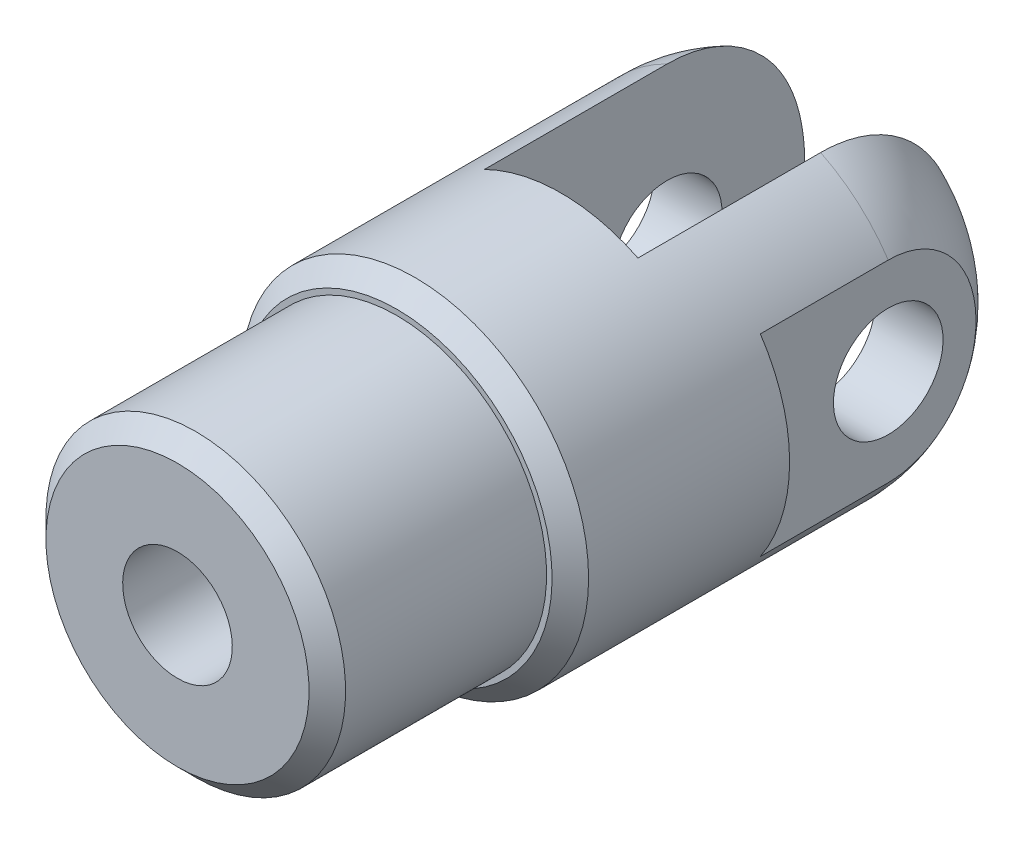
ISO-10303-21;
HEADER;
FILE_DESCRIPTION(('STEP AP214'),'2;1');
FILE_NAME('part.step','',(''),(''),'','','');
FILE_SCHEMA(('AUTOMOTIVE_DESIGN { 1 0 10303 214 1 1 1 1 }'));
ENDSEC;
DATA;
#1=APPLICATION_CONTEXT('core data for automotive mechanical design processes');
#2=APPLICATION_PROTOCOL_DEFINITION('international standard','automotive_design',2000,#1);
#3=PRODUCT_CONTEXT('',#1,'mechanical');
#4=PRODUCT('Part','Part','',(#3));
#5=PRODUCT_RELATED_PRODUCT_CATEGORY('part','',(#4));
#6=PRODUCT_DEFINITION_FORMATION('','',#4);
#7=PRODUCT_DEFINITION_CONTEXT('part definition',#1,'design');
#8=PRODUCT_DEFINITION('design','',#6,#7);
#9=PRODUCT_DEFINITION_SHAPE('','',#8);
#10=(LENGTH_UNIT() NAMED_UNIT(*) SI_UNIT(.MILLI.,.METRE.));
#11=(NAMED_UNIT(*) PLANE_ANGLE_UNIT() SI_UNIT($,.RADIAN.));
#12=(NAMED_UNIT(*) SI_UNIT($,.STERADIAN.) SOLID_ANGLE_UNIT());
#13=UNCERTAINTY_MEASURE_WITH_UNIT(LENGTH_MEASURE(1.E-05),#10,'distance_accuracy_value','');
#14=(GEOMETRIC_REPRESENTATION_CONTEXT(3) GLOBAL_UNCERTAINTY_ASSIGNED_CONTEXT((#13)) GLOBAL_UNIT_ASSIGNED_CONTEXT((#10,
#11,#12)) REPRESENTATION_CONTEXT('',''));
#15=CARTESIAN_POINT('',(0.,0.,0.));
#16=DIRECTION('',(0.,0.,1.));
#17=DIRECTION('',(1.,0.,0.));
#18=AXIS2_PLACEMENT_3D('',#15,#16,#17);
#19=CARTESIAN_POINT('',(0.,0.,11.));
#20=DIRECTION('',(0.,0.,-1.));
#21=DIRECTION('',(0.,1.,0.));
#22=AXIS2_PLACEMENT_3D('',#19,#20,#21);
#23=CONICAL_SURFACE('',#22,8.20000000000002,0.785398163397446);
#24=CARTESIAN_POINT('',(0.,0.,11.));
#25=DIRECTION('',(0.,0.,-1.));
#26=DIRECTION('',(0.,1.,0.));
#27=AXIS2_PLACEMENT_3D('',#24,#25,#26);
#28=CIRCLE('',#27,8.2);
#29=CARTESIAN_POINT('',(0.,8.19999999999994,11.));
#30=VERTEX_POINT('',#29);
#31=EDGE_CURVE('E132',#30,#30,#28,.T.);
#32=ORIENTED_EDGE('',*,*,#31,.F.);
#33=EDGE_LOOP('',(#32));
#34=FACE_BOUND('',#33,.T.);
#35=CARTESIAN_POINT('',(0.,0.,12.0000000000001));
#36=DIRECTION('',(0.,0.,-1.));
#37=DIRECTION('',(0.,1.,0.));
#38=AXIS2_PLACEMENT_3D('',#35,#36,#37);
#39=CIRCLE('',#38,7.2);
#40=CARTESIAN_POINT('',(0.,7.19999999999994,12.0000000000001));
#41=VERTEX_POINT('',#40);
#42=EDGE_CURVE('E19',#41,#41,#39,.F.);
#43=ORIENTED_EDGE('',*,*,#42,.F.);
#44=EDGE_LOOP('',(#43));
#45=FACE_BOUND('',#44,.T.);
#46=ADVANCED_FACE('F16',(#34,#45),#23,.T.);
#47=CARTESIAN_POINT('',(0.,0.,12.0000000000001));
#48=DIRECTION('',(0.,0.,1.));
#49=DIRECTION('',(0.,-1.,0.));
#50=AXIS2_PLACEMENT_3D('',#47,#48,#49);
#51=PLANE('',#50);
#52=ORIENTED_EDGE('',*,*,#42,.T.);
#53=EDGE_LOOP('',(#52));
#54=FACE_BOUND('',#53,.T.);
#55=CARTESIAN_POINT('',(0.,0.,12.0000000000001));
#56=DIRECTION('',(0.,0.,1.));
#57=DIRECTION('',(0.,-1.,0.));
#58=AXIS2_PLACEMENT_3D('',#55,#56,#57);
#59=CIRCLE('',#58,3.);
#60=CARTESIAN_POINT('',(0.,-3.00000000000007,12.0000000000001));
#61=VERTEX_POINT('',#60);
#62=EDGE_CURVE('E135',#61,#61,#59,.F.);
#63=ORIENTED_EDGE('',*,*,#62,.T.);
#64=EDGE_LOOP('',(#63));
#65=FACE_BOUND('',#64,.T.);
#66=ADVANCED_FACE('F257',(#54,#65),#51,.T.);
#67=CARTESIAN_POINT('',(0.,0.,12.0000000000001));
#68=DIRECTION('',(0.,0.,-1.));
#69=DIRECTION('',(0.,1.,0.));
#70=AXIS2_PLACEMENT_3D('',#67,#68,#69);
#71=CYLINDRICAL_SURFACE('',#70,8.2);
#72=CARTESIAN_POINT('',(0.,0.,0.));
#73=DIRECTION('',(0.,0.,-1.));
#74=DIRECTION('',(0.,1.,0.));
#75=AXIS2_PLACEMENT_3D('',#72,#73,#74);
#76=CIRCLE('',#75,8.2);
#77=CARTESIAN_POINT('',(0.,8.19999999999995,0.));
#78=VERTEX_POINT('',#77);
#79=EDGE_CURVE('E114',#78,#78,#76,.T.);
#80=ORIENTED_EDGE('',*,*,#79,.F.);
#81=EDGE_LOOP('',(#80));
#82=FACE_BOUND('',#81,.T.);
#83=ORIENTED_EDGE('',*,*,#31,.T.);
#84=EDGE_LOOP('',(#83));
#85=FACE_BOUND('',#84,.T.);
#86=ADVANCED_FACE('F254',(#82,#85),#71,.T.);
#87=CARTESIAN_POINT('',(-15.,-1.11022302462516E-13,-19.));
#88=DIRECTION('',(1.,0.,0.));
#89=DIRECTION('',(0.,1.,0.));
#90=AXIS2_PLACEMENT_3D('',#87,#88,#89);
#91=CYLINDRICAL_SURFACE('',#90,3.00000000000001);
#92=CARTESIAN_POINT('',(-4.2,-1.09434132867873E-13,-19.));
#93=DIRECTION('',(1.,0.,0.));
#94=DIRECTION('',(0.,1.,0.));
#95=AXIS2_PLACEMENT_3D('',#92,#93,#94);
#96=CIRCLE('',#95,3.00000000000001);
#97=CARTESIAN_POINT('',(-4.2,2.9999999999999,-19.));
#98=VERTEX_POINT('',#97);
#99=EDGE_CURVE('E92',#98,#98,#96,.T.);
#100=ORIENTED_EDGE('',*,*,#99,.T.);
#101=EDGE_LOOP('',(#100));
#102=FACE_BOUND('',#101,.T.);
#103=CARTESIAN_POINT('',(-7.9,-1.09978228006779E-13,-19.));
#104=DIRECTION('',(1.,0.,0.));
#105=DIRECTION('',(0.,1.,0.));
#106=AXIS2_PLACEMENT_3D('',#103,#104,#105);
#107=CIRCLE('',#106,3.00000000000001);
#108=CARTESIAN_POINT('',(-7.9,2.9999999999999,-19.));
#109=VERTEX_POINT('',#108);
#110=EDGE_CURVE('E93',#109,#109,#107,.T.);
#111=ORIENTED_EDGE('',*,*,#110,.F.);
#112=EDGE_LOOP('',(#111));
#113=FACE_BOUND('',#112,.T.);
#114=ADVANCED_FACE('F250',(#102,#113),#91,.F.);
#115=CARTESIAN_POINT('',(0.,0.,-17.4852813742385));
#116=DIRECTION('',(0.,0.,1.));
#117=DIRECTION('',(0.,-1.,0.));
#118=AXIS2_PLACEMENT_3D('',#115,#116,#117);
#119=CYLINDRICAL_SURFACE('',#118,3.);
#120=ORIENTED_EDGE('',*,*,#62,.F.);
#121=EDGE_LOOP('',(#120));
#122=FACE_BOUND('',#121,.T.);
#123=CARTESIAN_POINT('',(0.,0.,-9.00000000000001));
#124=DIRECTION('',(0.,0.,1.));
#125=DIRECTION('',(0.,-1.,0.));
#126=AXIS2_PLACEMENT_3D('',#123,#124,#125);
#127=CIRCLE('',#126,3.);
#128=CARTESIAN_POINT('',(0.,-3.00000000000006,-9.00000000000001));
#129=VERTEX_POINT('',#128);
#130=EDGE_CURVE('E188',#129,#129,#127,.F.);
#131=ORIENTED_EDGE('',*,*,#130,.T.);
#132=EDGE_LOOP('',(#131));
#133=FACE_BOUND('',#132,.T.);
#134=ADVANCED_FACE('F242',(#122,#133),#119,.F.);
#135=CARTESIAN_POINT('',(-15.,-1.11022302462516E-13,-19.));
#136=DIRECTION('',(1.,0.,0.));
#137=DIRECTION('',(0.,1.,0.));
#138=AXIS2_PLACEMENT_3D('',#135,#136,#137);
#139=CYLINDRICAL_SURFACE('',#138,3.00000000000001);
#140=CARTESIAN_POINT('',(4.2,-1.08198889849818E-13,-19.));
#141=DIRECTION('',(1.,0.,0.));
#142=DIRECTION('',(0.,1.,0.));
#143=AXIS2_PLACEMENT_3D('',#140,#141,#142);
#144=CIRCLE('',#143,3.00000000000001);
#145=CARTESIAN_POINT('',(4.19999999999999,2.9999999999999,-19.));
#146=VERTEX_POINT('',#145);
#147=EDGE_CURVE('E185',#146,#146,#144,.F.);
#148=ORIENTED_EDGE('',*,*,#147,.T.);
#149=EDGE_LOOP('',(#148));
#150=FACE_BOUND('',#149,.T.);
#151=CARTESIAN_POINT('',(7.9,-1.07654794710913E-13,-19.));
#152=DIRECTION('',(1.,0.,0.));
#153=DIRECTION('',(0.,1.,0.));
#154=AXIS2_PLACEMENT_3D('',#151,#152,#153);
#155=CIRCLE('',#154,3.00000000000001);
#156=CARTESIAN_POINT('',(7.9,2.9999999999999,-19.));
#157=VERTEX_POINT('',#156);
#158=EDGE_CURVE('E146',#157,#157,#155,.T.);
#159=ORIENTED_EDGE('',*,*,#158,.T.);
#160=EDGE_LOOP('',(#159));
#161=FACE_BOUND('',#160,.T.);
#162=ADVANCED_FACE('F233',(#150,#161),#139,.F.);
#163=CARTESIAN_POINT('',(0.,0.,0.));
#164=DIRECTION('',(0.,0.,1.));
#165=DIRECTION('',(0.,-1.,0.));
#166=AXIS2_PLACEMENT_3D('',#163,#164,#165);
#167=PLANE('',#166);
#168=ORIENTED_EDGE('',*,*,#79,.T.);
#169=EDGE_LOOP('',(#168));
#170=FACE_BOUND('',#169,.T.);
#171=CARTESIAN_POINT('',(0.,0.,0.));
#172=DIRECTION('',(0.,0.,-1.));
#173=DIRECTION('',(0.,1.,0.));
#174=AXIS2_PLACEMENT_3D('',#171,#172,#173);
#175=CIRCLE('',#174,8.5);
#176=CARTESIAN_POINT('',(0.,8.5,0.));
#177=VERTEX_POINT('',#176);
#178=EDGE_CURVE('E108',#177,#177,#175,.T.);
#179=ORIENTED_EDGE('',*,*,#178,.F.);
#180=EDGE_LOOP('',(#179));
#181=FACE_BOUND('',#180,.T.);
#182=ADVANCED_FACE('F230',(#170,#181),#167,.T.);
#183=CARTESIAN_POINT('',(-7.9,-15.0000000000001,-12.));
#184=DIRECTION('',(0.,0.,-1.));
#185=DIRECTION('',(0.,1.,0.));
#186=AXIS2_PLACEMENT_3D('',#183,#184,#185);
#187=PLANE('',#186);
#188=CARTESIAN_POINT('',(0.,0.,-12.));
#189=DIRECTION('',(0.,0.,1.));
#190=DIRECTION('',(0.,-1.,0.));
#191=AXIS2_PLACEMENT_3D('',#188,#189,#190);
#192=CIRCLE('',#191,9.5);
#193=CARTESIAN_POINT('',(-7.89999999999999,5.27636238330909,-12.));
#194=VERTEX_POINT('',#193);
#195=CARTESIAN_POINT('',(-7.9,-5.27636238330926,-12.));
#196=VERTEX_POINT('',#195);
#197=EDGE_CURVE('E106',#194,#196,#192,.T.);
#198=ORIENTED_EDGE('',*,*,#197,.F.);
#199=DIRECTION('',(0.,-1.,0.));
#200=VECTOR('',#199,1.);
#201=CARTESIAN_POINT('',(-7.9,-15.0000000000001,-12.));
#202=LINE('',#201,#200);
#203=EDGE_CURVE('E113',#196,#194,#202,.F.);
#204=ORIENTED_EDGE('',*,*,#203,.F.);
#205=EDGE_LOOP('',(#198,#204));
#206=FACE_BOUND('',#205,.T.);
#207=ADVANCED_FACE('F232',(#206),#187,.T.);
#208=CARTESIAN_POINT('',(-7.9,-15.0000000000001,-26.9999999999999));
#209=DIRECTION('',(-1.,0.,0.));
#210=DIRECTION('',(0.,-1.,0.));
#211=AXIS2_PLACEMENT_3D('',#208,#209,#210);
#212=PLANE('',#211);
#213=ORIENTED_EDGE('',*,*,#110,.T.);
#214=EDGE_LOOP('',(#213));
#215=FACE_BOUND('',#214,.T.);
#216=CARTESIAN_POINT('',(-7.9,-5.27636238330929,-19.));
#217=CARTESIAN_POINT('',(-7.9,-5.27638424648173,-19.1318026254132));
#218=CARTESIAN_POINT('',(-7.9,-5.27049878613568,-19.263599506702));
#219=CARTESIAN_POINT('',(-7.9,-5.24707312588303,-19.5261291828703));
#220=CARTESIAN_POINT('',(-7.9,-5.22953513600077,-19.6568621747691));
#221=CARTESIAN_POINT('',(-7.9,-5.18302671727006,-19.9159140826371));
#222=CARTESIAN_POINT('',(-7.9,-5.15408710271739,-20.044238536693));
#223=CARTESIAN_POINT('',(-7.9,-5.08507795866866,-20.2978575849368));
#224=CARTESIAN_POINT('',(-7.9,-5.04500832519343,-20.423152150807));
#225=CARTESIAN_POINT('',(-7.9,-4.9541562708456,-20.669743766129));
#226=CARTESIAN_POINT('',(-7.9,-4.90337744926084,-20.7910421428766));
#227=CARTESIAN_POINT('',(-7.9,-4.79157585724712,-21.0288769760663));
#228=CARTESIAN_POINT('',(-7.9,-4.73054899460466,-21.1454115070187));
#229=CARTESIAN_POINT('',(-7.9,-4.59886516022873,-21.372857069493));
#230=CARTESIAN_POINT('',(-7.9,-4.52821091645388,-21.4837696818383));
#231=CARTESIAN_POINT('',(-7.9,-4.3778806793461,-21.6993573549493));
#232=CARTESIAN_POINT('',(-7.9,-4.29820123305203,-21.804030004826));
#233=CARTESIAN_POINT('',(-7.9,-4.13111448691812,-22.0057994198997));
#234=CARTESIAN_POINT('',(-7.9,-4.0437642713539,-22.1029434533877));
#235=CARTESIAN_POINT('',(-7.9,-3.8615901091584,-22.289971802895));
#236=CARTESIAN_POINT('',(-7.9,-3.76676356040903,-22.3798535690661));
#237=CARTESIAN_POINT('',(-7.9,-3.47218292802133,-22.6379378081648));
#238=CARTESIAN_POINT('',(-7.9,-3.26222447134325,-22.7947030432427));
#239=CARTESIAN_POINT('',(-7.9,-2.80479313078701,-23.085679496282));
#240=CARTESIAN_POINT('',(-7.9,-2.55568515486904,-23.2172977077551));
#241=CARTESIAN_POINT('',(-7.9,-2.04040327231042,-23.4409599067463));
#242=CARTESIAN_POINT('',(-7.90000000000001,-1.77423016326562,-23.5330057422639));
#243=CARTESIAN_POINT('',(-7.89999999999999,-1.25796365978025,-23.6700578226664));
#244=CARTESIAN_POINT('',(-7.89999999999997,-1.00885292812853,-23.7187916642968));
#245=CARTESIAN_POINT('',(-7.90000000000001,-0.632215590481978,-23.7675103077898));
#246=CARTESIAN_POINT('',(-7.90000000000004,-0.506160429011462,-23.7796861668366));
#247=CARTESIAN_POINT('',(-7.89999999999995,-0.253419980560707,-23.7959351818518));
#248=CARTESIAN_POINT('',(-7.89999999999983,-0.126734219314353,-23.8000008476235));
#249=CARTESIAN_POINT('',(-7.89999999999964,0.308889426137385,-23.7999979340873));
#250=CARTESIAN_POINT('',(-7.89999999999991,0.618066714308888,-23.7758390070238));
#251=CARTESIAN_POINT('',(-7.90000000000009,1.22879826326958,-23.6790292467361));
#252=CARTESIAN_POINT('',(-7.90000000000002,1.53035265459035,-23.6063792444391));
#253=CARTESIAN_POINT('',(-7.89999999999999,1.97105174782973,-23.4611409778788));
#254=CARTESIAN_POINT('',(-7.9,2.11630179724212,-23.4065331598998));
#255=CARTESIAN_POINT('',(-7.9,2.40159681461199,-23.285304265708));
#256=CARTESIAN_POINT('',(-7.9,2.54164617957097,-23.2186936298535));
#257=CARTESIAN_POINT('',(-7.9,2.81547847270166,-23.073600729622));
#258=CARTESIAN_POINT('',(-7.9,2.94926060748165,-22.9951169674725));
#259=CARTESIAN_POINT('',(-7.9,3.20935883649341,-22.8265511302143));
#260=CARTESIAN_POINT('',(-7.9,3.33567358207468,-22.736466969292));
#261=CARTESIAN_POINT('',(-7.9,3.5767763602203,-22.5473234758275));
#262=CARTESIAN_POINT('',(-7.9,3.69176160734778,-22.4485157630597));
#263=CARTESIAN_POINT('',(-7.9,3.91221184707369,-22.2407952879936));
#264=CARTESIAN_POINT('',(-7.9,4.01767753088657,-22.1318832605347));
#265=CARTESIAN_POINT('',(-7.9,4.21793455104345,-21.9046745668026));
#266=CARTESIAN_POINT('',(-7.9,4.31272771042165,-21.7863795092));
#267=CARTESIAN_POINT('',(-7.9,4.49056207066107,-21.5412666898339));
#268=CARTESIAN_POINT('',(-7.9,4.57360464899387,-21.4144499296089));
#269=CARTESIAN_POINT('',(-7.9,4.71959914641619,-21.1658314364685));
#270=CARTESIAN_POINT('',(-7.9,4.78371309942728,-21.0447107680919));
#271=CARTESIAN_POINT('',(-7.9,4.90085328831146,-20.797228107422));
#272=CARTESIAN_POINT('',(-7.9,4.95388076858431,-20.6708667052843));
#273=CARTESIAN_POINT('',(-7.9,5.04822886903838,-20.4140240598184));
#274=CARTESIAN_POINT('',(-7.9,5.08956404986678,-20.283548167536));
#275=CARTESIAN_POINT('',(-7.9,5.16015221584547,-20.0194223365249));
#276=CARTESIAN_POINT('',(-7.9,5.18941047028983,-19.8857738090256));
#277=CARTESIAN_POINT('',(-7.9,5.2337190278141,-19.626992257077));
#278=CARTESIAN_POINT('',(-7.9,5.24970805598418,-19.5020191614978));
#279=CARTESIAN_POINT('',(-7.9,5.27102995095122,-19.251366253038));
#280=CARTESIAN_POINT('',(-7.9,5.27637955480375,-19.1256878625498));
#281=CARTESIAN_POINT('',(-7.9,5.27636238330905,-19.));
#282=B_SPLINE_CURVE_WITH_KNOTS('',3,(#216,#217,#218,#219,#220,#221,#222,#223,#224,#225,#226,
#227,#228,#229,#230,#231,#232,#233,#234,#235,#236,#237,#238,#239,#240,#241,#242,#243,#244,#245,
#246,#247,#248,#249,#250,#251,#252,#253,#254,#255,#256,#257,#258,#259,#260,#261,#262,#263,#264,
#265,#266,#267,#268,#269,#270,#271,#272,#273,#274,#275,#276,#277,#278,#279,#280,#281),
.UNSPECIFIED.,.F.,.F.,(4,2,2,2,2,2,2,2,2,2,2,2,2,2,2,2,2,2,2,2,2,2,2,2,2,2,2,2,2,2,2,2,4),(0.,
0.39526781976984,0.790460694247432,1.18459275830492,1.57872850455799,1.97273199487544,
2.36689319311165,2.76094293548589,3.15514395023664,3.54662638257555,3.93824567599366,
4.72100573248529,5.56280619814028,6.404567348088,7.1637858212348,7.54347946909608,
7.92352362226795,8.84980557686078,9.77607165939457,10.2411379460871,10.7058016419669,
11.1705240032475,11.6353300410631,12.089532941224,12.5437028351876,12.9977950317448,
13.451833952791,13.8624318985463,14.2729837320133,14.6830220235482,15.0928812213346,
15.4704086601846,15.8473417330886),.UNSPECIFIED.);
#283=CARTESIAN_POINT('',(-7.9,-5.27636238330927,-19.));
#284=VERTEX_POINT('',#283);
#285=CARTESIAN_POINT('',(-7.89999999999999,5.27636238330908,-19.));
#286=VERTEX_POINT('',#285);
#287=EDGE_CURVE('E80',#284,#286,#282,.T.);
#288=ORIENTED_EDGE('',*,*,#287,.F.);
#289=DIRECTION('',(0.,0.,1.));
#290=VECTOR('',#289,1.);
#291=CARTESIAN_POINT('',(-7.9,-5.27636238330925,-27.));
#292=LINE('',#291,#290);
#293=EDGE_CURVE('E85',#196,#284,#292,.F.);
#294=ORIENTED_EDGE('',*,*,#293,.F.);
#295=ORIENTED_EDGE('',*,*,#203,.T.);
#296=DIRECTION('',(0.,0.,1.));
#297=VECTOR('',#296,1.);
#298=CARTESIAN_POINT('',(-7.89999999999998,5.27636238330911,-27.));
#299=LINE('',#298,#297);
#300=EDGE_CURVE('E88',#286,#194,#299,.T.);
#301=ORIENTED_EDGE('',*,*,#300,.F.);
#302=EDGE_LOOP('',(#288,#294,#295,#301));
#303=FACE_BOUND('',#302,.T.);
#304=ADVANCED_FACE('F82',(#215,#303),#212,.T.);
#305=CARTESIAN_POINT('',(1.5,-1.10801723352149E-13,-19.));
#306=DIRECTION('',(0.,1.,0.));
#307=DIRECTION('',(1.,0.,0.));
#308=AXIS2_PLACEMENT_3D('',#305,#306,#307);
#309=CIRCLE('',#308,8.);
#310=TRIMMED_CURVE('',#309,(PARAMETER_VALUE(-1.7594127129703)),
(PARAMETER_VALUE(1.7594127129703)),.T.,.PARAMETER.);
#311=CARTESIAN_POINT('',(0.,-1.11022302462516E-13,-19.));
#312=DIRECTION('',(0.,0.,1.));
#313=AXIS1_PLACEMENT('',#311,#312);
#314=SURFACE_OF_REVOLUTION('',#310,#313);
#315=CARTESIAN_POINT('',(0.,0.,-19.));
#316=DIRECTION('',(0.,0.,1.));
#317=DIRECTION('',(0.,-1.,0.));
#318=AXIS2_PLACEMENT_3D('',#315,#316,#317);
#319=CIRCLE('',#318,9.5);
#320=CARTESIAN_POINT('',(-4.2,-8.52115015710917,-19.));
#321=VERTEX_POINT('',#320);
#322=EDGE_CURVE('E96',#284,#321,#319,.T.);
#323=ORIENTED_EDGE('',*,*,#322,.F.);
#324=ORIENTED_EDGE('',*,*,#287,.T.);
#325=CARTESIAN_POINT('',(0.,0.,-19.));
#326=DIRECTION('',(0.,0.,1.));
#327=DIRECTION('',(0.,-1.,0.));
#328=AXIS2_PLACEMENT_3D('',#325,#326,#327);
#329=CIRCLE('',#328,9.5);
#330=CARTESIAN_POINT('',(-4.19999999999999,8.52115015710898,-19.));
#331=VERTEX_POINT('',#330);
#332=EDGE_CURVE('E116',#331,#286,#329,.T.);
#333=ORIENTED_EDGE('',*,*,#332,.F.);
#334=CARTESIAN_POINT('',(-4.2,8.52115015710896,-19.));
#335=CARTESIAN_POINT('',(-4.2,8.5211744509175,-19.2030791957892));
#336=CARTESIAN_POINT('',(-4.2,8.51253021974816,-19.4061540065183));
#337=CARTESIAN_POINT('',(-4.2,8.47808070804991,-19.8108267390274));
#338=CARTESIAN_POINT('',(-4.2,8.45227683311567,-20.0124247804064));
#339=CARTESIAN_POINT('',(-4.2,8.38373010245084,-20.4124404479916));
#340=CARTESIAN_POINT('',(-4.2,8.34101007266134,-20.6108619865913));
#341=CARTESIAN_POINT('',(-4.2,8.23897339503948,-21.0033881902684));
#342=CARTESIAN_POINT('',(-4.2,8.17965685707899,-21.197492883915));
#343=CARTESIAN_POINT('',(-4.2,8.0448692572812,-21.5800732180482));
#344=CARTESIAN_POINT('',(-4.2,7.96939341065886,-21.7685471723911));
#345=CARTESIAN_POINT('',(-4.2,7.80288692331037,-22.1384949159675));
#346=CARTESIAN_POINT('',(-4.2,7.71185607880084,-22.3199686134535));
#347=CARTESIAN_POINT('',(-4.2,7.51495444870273,-22.6746630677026));
#348=CARTESIAN_POINT('',(-4.2,7.40908444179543,-22.8478842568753));
#349=CARTESIAN_POINT('',(-4.2,7.18332251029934,-23.1849305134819));
#350=CARTESIAN_POINT('',(-4.20000000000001,7.06343056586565,-23.3487555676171));
#351=CARTESIAN_POINT('',(-4.20000000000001,6.80953949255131,-23.6672259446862));
#352=CARTESIAN_POINT('',(-4.2,6.67543543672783,-23.8217875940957));
#353=CARTESIAN_POINT('',(-4.2,6.39496321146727,-24.1193436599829));
#354=CARTESIAN_POINT('',(-4.2,6.24859502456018,-24.2623380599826));
#355=CARTESIAN_POINT('',(-4.2,5.94473625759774,-24.5359331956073));
#356=CARTESIAN_POINT('',(-4.2,5.78724685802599,-24.6665352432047));
#357=CARTESIAN_POINT('',(-4.2,5.46231799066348,-24.9147164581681));
#358=CARTESIAN_POINT('',(-4.2,5.294877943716,-25.0322948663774));
#359=CARTESIAN_POINT('',(-4.2,4.94525649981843,-25.2578436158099));
#360=CARTESIAN_POINT('',(-4.2,4.76276387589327,-25.365331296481));
#361=CARTESIAN_POINT('',(-4.2,4.38986202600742,-25.565536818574));
#362=CARTESIAN_POINT('',(-4.2,4.19945264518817,-25.6582543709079));
#363=CARTESIAN_POINT('',(-4.2,3.81203929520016,-25.828908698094));
#364=CARTESIAN_POINT('',(-4.2,3.61503251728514,-25.9068390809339));
#365=CARTESIAN_POINT('',(-4.2,3.21586899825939,-26.0480895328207));
#366=CARTESIAN_POINT('',(-4.2,3.01371216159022,-26.1114093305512));
#367=CARTESIAN_POINT('',(-4.2,2.58132135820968,-26.2305865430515));
#368=CARTESIAN_POINT('',(-4.2,2.35059929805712,-26.2846701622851));
#369=CARTESIAN_POINT('',(-4.2,1.8858673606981,-26.376143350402));
#370=CARTESIAN_POINT('',(-4.2,1.65185691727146,-26.4135300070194));
#371=CARTESIAN_POINT('',(-4.2,1.18195779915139,-26.4727141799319));
#372=CARTESIAN_POINT('',(-4.2,0.946069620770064,-26.4945156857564));
#373=CARTESIAN_POINT('',(-4.2,0.473457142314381,-26.5234582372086));
#374=CARTESIAN_POINT('',(-4.2,0.236732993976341,-26.5306018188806));
#375=CARTESIAN_POINT('',(-4.2,-0.267488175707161,-26.5306069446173));
#376=CARTESIAN_POINT('',(-4.2,-0.534987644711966,-26.5214924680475));
#377=CARTESIAN_POINT('',(-4.2,-1.0688015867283,-26.4844483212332));
#378=CARTESIAN_POINT('',(-4.20000000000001,-1.33511558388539,-26.4565116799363));
#379=CARTESIAN_POINT('',(-4.20000000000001,-1.8676698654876,-26.3799775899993));
#380=CARTESIAN_POINT('',(-4.20000000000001,-2.13387992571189,-26.3311659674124));
#381=CARTESIAN_POINT('',(-4.2,-2.66133157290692,-26.2111843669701));
#382=CARTESIAN_POINT('',(-4.19999999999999,-2.92257207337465,-26.1400095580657));
#383=CARTESIAN_POINT('',(-4.20000000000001,-3.43758190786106,-25.9740137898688));
#384=CARTESIAN_POINT('',(-4.20000000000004,-3.69134867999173,-25.8791848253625));
#385=CARTESIAN_POINT('',(-4.19999999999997,-4.18847070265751,-25.6653018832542));
#386=CARTESIAN_POINT('',(-4.19999999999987,-4.43182753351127,-25.5462515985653));
#387=CARTESIAN_POINT('',(-4.19999999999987,-4.89036223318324,-25.2922705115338));
#388=CARTESIAN_POINT('',(-4.19999999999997,-5.10635023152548,-25.1588032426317));
#389=CARTESIAN_POINT('',(-4.20000000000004,-5.52421965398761,-24.8713077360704));
#390=CARTESIAN_POINT('',(-4.20000000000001,-5.7261007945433,-24.7172790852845));
#391=CARTESIAN_POINT('',(-4.19999999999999,-6.11331150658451,-24.3898320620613));
#392=CARTESIAN_POINT('',(-4.2,-6.29864940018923,-24.2164235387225));
#393=CARTESIAN_POINT('',(-4.2,-6.65068622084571,-23.8516391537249));
#394=CARTESIAN_POINT('',(-4.19999999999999,-6.81738833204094,-23.6602663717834));
#395=CARTESIAN_POINT('',(-4.19999999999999,-7.10609241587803,-23.2920940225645));
#396=CARTESIAN_POINT('',(-4.2,-7.23102549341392,-23.1175834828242));
#397=CARTESIAN_POINT('',(-4.2,-7.46506743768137,-22.7582623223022));
#398=CARTESIAN_POINT('',(-4.2,-7.57417786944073,-22.5734527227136));
#399=CARTESIAN_POINT('',(-4.2,-7.77557997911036,-22.1950099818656));
#400=CARTESIAN_POINT('',(-4.20000000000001,-7.86788024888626,-22.0013814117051));
#401=CARTESIAN_POINT('',(-4.2,-8.03492671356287,-21.606699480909));
#402=CARTESIAN_POINT('',(-4.19999999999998,-8.10967421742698,-21.4056466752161));
#403=CARTESIAN_POINT('',(-4.19999999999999,-8.23243773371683,-21.0241990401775));
#404=CARTESIAN_POINT('',(-4.2,-8.28266452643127,-20.8445117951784));
#405=CARTESIAN_POINT('',(-4.2,-8.36900857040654,-20.4817941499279));
#406=CARTESIAN_POINT('',(-4.2,-8.40512750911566,-20.2987641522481));
#407=CARTESIAN_POINT('',(-4.2,-8.46303013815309,-19.9303621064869));
#408=CARTESIAN_POINT('',(-4.2,-8.48480696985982,-19.7449889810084));
#409=CARTESIAN_POINT('',(-4.2,-8.51387677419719,-19.3730785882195));
#410=CARTESIAN_POINT('',(-4.2,-8.52116723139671,-19.186541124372));
#411=CARTESIAN_POINT('',(-4.2,-8.52115015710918,-19.));
#412=B_SPLINE_CURVE_WITH_KNOTS('',3,(#334,#335,#336,#337,#338,#339,#340,#341,#342,#343,#344,
#345,#346,#347,#348,#349,#350,#351,#352,#353,#354,#355,#356,#357,#358,#359,#360,#361,#362,#363,
#364,#365,#366,#367,#368,#369,#370,#371,#372,#373,#374,#375,#376,#377,#378,#379,#380,#381,#382,
#383,#384,#385,#386,#387,#388,#389,#390,#391,#392,#393,#394,#395,#396,#397,#398,#399,#400,#401,
#402,#403,#404,#405,#406,#407,#408,#409,#410,#411),.UNSPECIFIED.,.F.,.F.,(4,2,2,2,2,2,2,2,2,2,2,
2,2,2,2,2,2,2,2,2,2,2,2,2,2,2,2,2,2,2,2,2,2,2,2,2,2,2,4),(0.,0.609047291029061,1.21804469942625,
1.82622313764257,2.43439754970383,3.04275229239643,3.65111500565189,4.25944580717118,
4.86777746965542,5.48096293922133,6.09414928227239,6.70727063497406,7.32042770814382,
7.95512580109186,8.58983631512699,9.22482057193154,9.85981661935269,10.5700696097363,
11.2804464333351,11.9906413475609,12.7007133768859,13.5030344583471,14.3056528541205,
15.1167113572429,15.9279451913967,16.7394539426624,17.5508390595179,18.3113554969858,
19.0718872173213,19.8320341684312,20.5920510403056,21.2351160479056,21.8781174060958,
22.5207891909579,23.1634130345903,23.7225908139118,24.2817016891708,24.8410797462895,
25.400554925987),.UNSPECIFIED.);
#413=EDGE_CURVE('E98',#331,#321,#412,.T.);
#414=ORIENTED_EDGE('',*,*,#413,.T.);
#415=EDGE_LOOP('',(#323,#324,#333,#414));
#416=FACE_BOUND('',#415,.T.);
#417=ADVANCED_FACE('F97',(#416),#314,.F.);
#418=CARTESIAN_POINT('',(-4.2,-15.0000000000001,-26.9999999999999));
#419=DIRECTION('',(-1.,0.,0.));
#420=DIRECTION('',(0.,0.,1.));
#421=AXIS2_PLACEMENT_3D('',#418,#419,#420);
#422=PLANE('',#421);
#423=ORIENTED_EDGE('',*,*,#413,.F.);
#424=DIRECTION('',(0.,0.,1.));
#425=VECTOR('',#424,1.);
#426=CARTESIAN_POINT('',(-4.19999999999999,8.521150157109,-27.));
#427=LINE('',#426,#425);
#428=CARTESIAN_POINT('',(-4.19999999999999,8.52115015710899,-9.00000000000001));
#429=VERTEX_POINT('',#428);
#430=EDGE_CURVE('E118',#429,#331,#427,.F.);
#431=ORIENTED_EDGE('',*,*,#430,.F.);
#432=DIRECTION('',(0.,-1.,0.));
#433=VECTOR('',#432,1.);
#434=CARTESIAN_POINT('',(-4.2,-15.0000000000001,-9.00000000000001));
#435=LINE('',#434,#433);
#436=CARTESIAN_POINT('',(-4.2,-8.52115015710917,-8.99999999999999));
#437=VERTEX_POINT('',#436);
#438=EDGE_CURVE('E186',#429,#437,#435,.T.);
#439=ORIENTED_EDGE('',*,*,#438,.T.);
#440=DIRECTION('',(0.,0.,1.));
#441=VECTOR('',#440,1.);
#442=CARTESIAN_POINT('',(-4.2,-8.52115015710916,-27.));
#443=LINE('',#442,#441);
#444=EDGE_CURVE('E102',#321,#437,#443,.T.);
#445=ORIENTED_EDGE('',*,*,#444,.F.);
#446=EDGE_LOOP('',(#423,#431,#439,#445));
#447=FACE_BOUND('',#446,.T.);
#448=ORIENTED_EDGE('',*,*,#99,.F.);
#449=EDGE_LOOP('',(#448));
#450=FACE_BOUND('',#449,.T.);
#451=ADVANCED_FACE('F191',(#447,#450),#422,.F.);
#452=CARTESIAN_POINT('',(-4.2,-15.0000000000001,-9.00000000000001));
#453=DIRECTION('',(0.,0.,1.));
#454=DIRECTION('',(0.,-1.,0.));
#455=AXIS2_PLACEMENT_3D('',#452,#453,#454);
#456=PLANE('',#455);
#457=ORIENTED_EDGE('',*,*,#438,.F.);
#458=CARTESIAN_POINT('',(0.,0.,-9.00000000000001));
#459=DIRECTION('',(0.,0.,1.));
#460=DIRECTION('',(0.,-1.,0.));
#461=AXIS2_PLACEMENT_3D('',#458,#459,#460);
#462=CIRCLE('',#461,9.5);
#463=CARTESIAN_POINT('',(4.2,8.52115015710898,-9.00000000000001));
#464=VERTEX_POINT('',#463);
#465=EDGE_CURVE('E122',#464,#429,#462,.T.);
#466=ORIENTED_EDGE('',*,*,#465,.F.);
#467=DIRECTION('',(0.,1.,0.));
#468=VECTOR('',#467,1.);
#469=CARTESIAN_POINT('',(4.2,-15.0000000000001,-9.00000000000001));
#470=LINE('',#469,#468);
#471=CARTESIAN_POINT('',(4.2,-8.52115015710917,-8.99999999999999));
#472=VERTEX_POINT('',#471);
#473=EDGE_CURVE('E183',#464,#472,#470,.F.);
#474=ORIENTED_EDGE('',*,*,#473,.T.);
#475=CARTESIAN_POINT('',(0.,0.,-8.99999999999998));
#476=DIRECTION('',(0.,0.,1.));
#477=DIRECTION('',(0.,-1.,0.));
#478=AXIS2_PLACEMENT_3D('',#475,#476,#477);
#479=CIRCLE('',#478,9.5);
#480=EDGE_CURVE('E138',#437,#472,#479,.T.);
#481=ORIENTED_EDGE('',*,*,#480,.F.);
#482=EDGE_LOOP('',(#457,#466,#474,#481));
#483=FACE_BOUND('',#482,.T.);
#484=ORIENTED_EDGE('',*,*,#130,.F.);
#485=EDGE_LOOP('',(#484));
#486=FACE_BOUND('',#485,.T.);
#487=ADVANCED_FACE('F196',(#483,#486),#456,.F.);
#488=CARTESIAN_POINT('',(4.2,-15.0000000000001,-26.9999999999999));
#489=DIRECTION('',(1.,0.,0.));
#490=DIRECTION('',(0.,1.,0.));
#491=AXIS2_PLACEMENT_3D('',#488,#489,#490);
#492=PLANE('',#491);
#493=DIRECTION('',(0.,0.,1.));
#494=VECTOR('',#493,1.);
#495=CARTESIAN_POINT('',(4.2,8.52115015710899,-27.));
#496=LINE('',#495,#494);
#497=CARTESIAN_POINT('',(4.2,8.52115015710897,-19.));
#498=VERTEX_POINT('',#497);
#499=EDGE_CURVE('E123',#498,#464,#496,.T.);
#500=ORIENTED_EDGE('',*,*,#499,.F.);
#501=CARTESIAN_POINT('',(4.20000000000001,-8.52115015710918,-19.));
#502=CARTESIAN_POINT('',(4.2,-8.52117445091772,-19.2030791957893));
#503=CARTESIAN_POINT('',(4.2,-8.51253021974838,-19.4061540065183));
#504=CARTESIAN_POINT('',(4.2,-8.47808070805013,-19.8108267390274));
#505=CARTESIAN_POINT('',(4.2,-8.45227683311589,-20.0124247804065));
#506=CARTESIAN_POINT('',(4.2,-8.38373010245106,-20.4124404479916));
#507=CARTESIAN_POINT('',(4.2,-8.34101007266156,-20.6108619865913));
#508=CARTESIAN_POINT('',(4.2,-8.2389733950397,-21.0033881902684));
#509=CARTESIAN_POINT('',(4.2,-8.1796568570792,-21.197492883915));
#510=CARTESIAN_POINT('',(4.2,-8.04486925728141,-21.5800732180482));
#511=CARTESIAN_POINT('',(4.2,-7.96939341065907,-21.7685471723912));
#512=CARTESIAN_POINT('',(4.2,-7.80288692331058,-22.1384949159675));
#513=CARTESIAN_POINT('',(4.2,-7.71185607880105,-22.3199686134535));
#514=CARTESIAN_POINT('',(4.2,-7.51495444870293,-22.6746630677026));
#515=CARTESIAN_POINT('',(4.2,-7.40908444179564,-22.8478842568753));
#516=CARTESIAN_POINT('',(4.2,-7.18332251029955,-23.1849305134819));
#517=CARTESIAN_POINT('',(4.2,-7.06343056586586,-23.3487555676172));
#518=CARTESIAN_POINT('',(4.2,-6.80953949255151,-23.6672259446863));
#519=CARTESIAN_POINT('',(4.2,-6.67543543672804,-23.8217875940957));
#520=CARTESIAN_POINT('',(4.2,-6.39496321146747,-24.1193436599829));
#521=CARTESIAN_POINT('',(4.2,-6.24859502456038,-24.2623380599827));
#522=CARTESIAN_POINT('',(4.2,-5.94473625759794,-24.5359331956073));
#523=CARTESIAN_POINT('',(4.2,-5.7872468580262,-24.6665352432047));
#524=CARTESIAN_POINT('',(4.2,-5.46231799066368,-24.9147164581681));
#525=CARTESIAN_POINT('',(4.2,-5.2948779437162,-25.0322948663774));
#526=CARTESIAN_POINT('',(4.2,-4.94525649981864,-25.2578436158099));
#527=CARTESIAN_POINT('',(4.2,-4.76276387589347,-25.365331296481));
#528=CARTESIAN_POINT('',(4.2,-4.38986202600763,-25.565536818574));
#529=CARTESIAN_POINT('',(4.2,-4.19945264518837,-25.658254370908));
#530=CARTESIAN_POINT('',(4.2,-3.81203929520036,-25.828908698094));
#531=CARTESIAN_POINT('',(4.2,-3.61503251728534,-25.9068390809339));
#532=CARTESIAN_POINT('',(4.2,-3.21586899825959,-26.0480895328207));
#533=CARTESIAN_POINT('',(4.2,-3.01371216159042,-26.1114093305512));
#534=CARTESIAN_POINT('',(4.2,-2.58132135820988,-26.2305865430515));
#535=CARTESIAN_POINT('',(4.2,-2.35059929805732,-26.2846701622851));
#536=CARTESIAN_POINT('',(4.2,-1.88586736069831,-26.376143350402));
#537=CARTESIAN_POINT('',(4.2,-1.65185691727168,-26.4135300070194));
#538=CARTESIAN_POINT('',(4.2,-1.18195779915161,-26.4727141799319));
#539=CARTESIAN_POINT('',(4.20000000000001,-0.946069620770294,-26.4945156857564));
#540=CARTESIAN_POINT('',(4.19999999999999,-0.473457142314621,-26.5234582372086));
#541=CARTESIAN_POINT('',(4.19999999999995,-0.236732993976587,-26.5306018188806));
#542=CARTESIAN_POINT('',(4.19999999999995,0.267488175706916,-26.5306069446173));
#543=CARTESIAN_POINT('',(4.19999999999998,0.534987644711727,-26.5214924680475));
#544=CARTESIAN_POINT('',(4.20000000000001,1.06880158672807,-26.4844483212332));
#545=CARTESIAN_POINT('',(4.2,1.33511558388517,-26.4565116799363));
#546=CARTESIAN_POINT('',(4.2,1.86766986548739,-26.3799775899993));
#547=CARTESIAN_POINT('',(4.2,2.13387992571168,-26.3311659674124));
#548=CARTESIAN_POINT('',(4.2,2.66133157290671,-26.2111843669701));
#549=CARTESIAN_POINT('',(4.19999999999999,2.92257207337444,-26.1400095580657));
#550=CARTESIAN_POINT('',(4.20000000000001,3.43758190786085,-25.9740137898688));
#551=CARTESIAN_POINT('',(4.20000000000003,3.69134867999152,-25.8791848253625));
#552=CARTESIAN_POINT('',(4.19999999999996,4.1884707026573,-25.6653018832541));
#553=CARTESIAN_POINT('',(4.19999999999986,4.43182753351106,-25.5462515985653));
#554=CARTESIAN_POINT('',(4.19999999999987,4.89036223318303,-25.2922705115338));
#555=CARTESIAN_POINT('',(4.19999999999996,5.10635023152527,-25.1588032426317));
#556=CARTESIAN_POINT('',(4.20000000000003,5.5242196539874,-24.8713077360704));
#557=CARTESIAN_POINT('',(4.20000000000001,5.72610079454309,-24.7172790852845));
#558=CARTESIAN_POINT('',(4.19999999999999,6.11331150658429,-24.3898320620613));
#559=CARTESIAN_POINT('',(4.2,6.29864940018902,-24.2164235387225));
#560=CARTESIAN_POINT('',(4.2,6.65068622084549,-23.8516391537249));
#561=CARTESIAN_POINT('',(4.2,6.81738833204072,-23.6602663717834));
#562=CARTESIAN_POINT('',(4.2,7.10609241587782,-23.2920940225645));
#563=CARTESIAN_POINT('',(4.2,7.23102549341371,-23.1175834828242));
#564=CARTESIAN_POINT('',(4.2,7.46506743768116,-22.7582623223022));
#565=CARTESIAN_POINT('',(4.2,7.57417786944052,-22.5734527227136));
#566=CARTESIAN_POINT('',(4.2,7.77557997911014,-22.1950099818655));
#567=CARTESIAN_POINT('',(4.2,7.86788024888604,-22.0013814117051));
#568=CARTESIAN_POINT('',(4.2,8.03492671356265,-21.606699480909));
#569=CARTESIAN_POINT('',(4.19999999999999,8.10967421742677,-21.4056466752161));
#570=CARTESIAN_POINT('',(4.19999999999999,8.23243773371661,-21.0241990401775));
#571=CARTESIAN_POINT('',(4.2,8.28266452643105,-20.8445117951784));
#572=CARTESIAN_POINT('',(4.2,8.36900857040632,-20.4817941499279));
#573=CARTESIAN_POINT('',(4.2,8.40512750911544,-20.2987641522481));
#574=CARTESIAN_POINT('',(4.2,8.46303013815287,-19.9303621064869));
#575=CARTESIAN_POINT('',(4.2,8.4848069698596,-19.7449889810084));
#576=CARTESIAN_POINT('',(4.2,8.51387677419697,-19.3730785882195));
#577=CARTESIAN_POINT('',(4.2,8.52116723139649,-19.186541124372));
#578=CARTESIAN_POINT('',(4.2,8.52115015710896,-19.));
#579=B_SPLINE_CURVE_WITH_KNOTS('',3,(#501,#502,#503,#504,#505,#506,#507,#508,#509,#510,#511,
#512,#513,#514,#515,#516,#517,#518,#519,#520,#521,#522,#523,#524,#525,#526,#527,#528,#529,#530,
#531,#532,#533,#534,#535,#536,#537,#538,#539,#540,#541,#542,#543,#544,#545,#546,#547,#548,#549,
#550,#551,#552,#553,#554,#555,#556,#557,#558,#559,#560,#561,#562,#563,#564,#565,#566,#567,#568,
#569,#570,#571,#572,#573,#574,#575,#576,#577,#578),.UNSPECIFIED.,.F.,.F.,(4,2,2,2,2,2,2,2,2,2,2,
2,2,2,2,2,2,2,2,2,2,2,2,2,2,2,2,2,2,2,2,2,2,2,2,2,2,2,4),(0.,0.609047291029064,1.21804469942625,
1.82622313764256,2.43439754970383,3.04275229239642,3.65111500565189,4.25944580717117,
4.86777746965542,5.48096293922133,6.09414928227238,6.70727063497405,7.32042770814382,
7.95512580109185,8.58983631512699,9.22482057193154,9.85981661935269,10.5700696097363,
11.2804464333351,11.9906413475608,12.7007133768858,13.5030344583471,14.3056528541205,
15.1167113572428,15.9279451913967,16.7394539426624,17.5508390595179,18.3113554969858,
19.0718872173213,19.8320341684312,20.5920510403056,21.2351160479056,21.8781174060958,
22.5207891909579,23.1634130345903,23.7225908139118,24.2817016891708,24.8410797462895,
25.400554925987),.UNSPECIFIED.);
#580=CARTESIAN_POINT('',(4.2,-8.52115015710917,-19.));
#581=VERTEX_POINT('',#580);
#582=EDGE_CURVE('E157',#581,#498,#579,.T.);
#583=ORIENTED_EDGE('',*,*,#582,.F.);
#584=DIRECTION('',(0.,0.,1.));
#585=VECTOR('',#584,1.);
#586=CARTESIAN_POINT('',(4.2,-8.52115015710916,-27.));
#587=LINE('',#586,#585);
#588=EDGE_CURVE('E140',#472,#581,#587,.F.);
#589=ORIENTED_EDGE('',*,*,#588,.F.);
#590=ORIENTED_EDGE('',*,*,#473,.F.);
#591=EDGE_LOOP('',(#500,#583,#589,#590));
#592=FACE_BOUND('',#591,.T.);
#593=ORIENTED_EDGE('',*,*,#147,.F.);
#594=EDGE_LOOP('',(#593));
#595=FACE_BOUND('',#594,.T.);
#596=ADVANCED_FACE('F171',(#592,#595),#492,.F.);
#597=CARTESIAN_POINT('',(1.5,-1.10801723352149E-13,-19.));
#598=DIRECTION('',(0.,1.,0.));
#599=DIRECTION('',(1.,0.,0.));
#600=AXIS2_PLACEMENT_3D('',#597,#598,#599);
#601=CIRCLE('',#600,8.);
#602=TRIMMED_CURVE('',#601,(PARAMETER_VALUE(-1.7594127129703)),
(PARAMETER_VALUE(1.7594127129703)),.T.,.PARAMETER.);
#603=CARTESIAN_POINT('',(0.,-1.11022302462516E-13,-19.));
#604=DIRECTION('',(0.,0.,1.));
#605=AXIS1_PLACEMENT('',#603,#604);
#606=SURFACE_OF_REVOLUTION('',#602,#605);
#607=CARTESIAN_POINT('',(7.9,5.27636238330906,-19.));
#608=CARTESIAN_POINT('',(7.9,5.27638424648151,-19.1318026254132));
#609=CARTESIAN_POINT('',(7.9,5.27049878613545,-19.2635995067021));
#610=CARTESIAN_POINT('',(7.9,5.24707312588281,-19.5261291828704));
#611=CARTESIAN_POINT('',(7.9,5.22953513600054,-19.6568621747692));
#612=CARTESIAN_POINT('',(7.9,5.18302671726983,-19.9159140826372));
#613=CARTESIAN_POINT('',(7.9,5.15408710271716,-20.044238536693));
#614=CARTESIAN_POINT('',(7.9,5.08507795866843,-20.2978575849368));
#615=CARTESIAN_POINT('',(7.9,5.04500832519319,-20.423152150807));
#616=CARTESIAN_POINT('',(7.9,4.95415627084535,-20.669743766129));
#617=CARTESIAN_POINT('',(7.9,4.9033774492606,-20.7910421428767));
#618=CARTESIAN_POINT('',(7.9,4.79157585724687,-21.0288769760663));
#619=CARTESIAN_POINT('',(7.9,4.73054899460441,-21.1454115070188));
#620=CARTESIAN_POINT('',(7.9,4.59886516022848,-21.3728570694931));
#621=CARTESIAN_POINT('',(7.9,4.52821091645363,-21.4837696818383));
#622=CARTESIAN_POINT('',(7.9,4.37788067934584,-21.6993573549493));
#623=CARTESIAN_POINT('',(7.9,4.29820123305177,-21.8040300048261));
#624=CARTESIAN_POINT('',(7.9,4.13111448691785,-22.0057994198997));
#625=CARTESIAN_POINT('',(7.9,4.04376427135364,-22.1029434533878));
#626=CARTESIAN_POINT('',(7.9,3.86159010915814,-22.289971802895));
#627=CARTESIAN_POINT('',(7.9,3.76676356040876,-22.3798535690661));
#628=CARTESIAN_POINT('',(7.9,3.47218292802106,-22.6379378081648));
#629=CARTESIAN_POINT('',(7.9,3.26222447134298,-22.7947030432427));
#630=CARTESIAN_POINT('',(7.9,2.80479313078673,-23.085679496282));
#631=CARTESIAN_POINT('',(7.9,2.55568515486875,-23.2172977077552));
#632=CARTESIAN_POINT('',(7.9,2.04040327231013,-23.4409599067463));
#633=CARTESIAN_POINT('',(7.9,1.77423016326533,-23.5330057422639));
#634=CARTESIAN_POINT('',(7.9,1.25796365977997,-23.6700578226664));
#635=CARTESIAN_POINT('',(7.9,1.00885292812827,-23.7187916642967));
#636=CARTESIAN_POINT('',(7.9,0.632215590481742,-23.7675103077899));
#637=CARTESIAN_POINT('',(7.9,0.506160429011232,-23.7796861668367));
#638=CARTESIAN_POINT('',(7.9,0.253419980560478,-23.7959351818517));
#639=CARTESIAN_POINT('',(7.9,0.12673421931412,-23.8000008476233));
#640=CARTESIAN_POINT('',(7.9,-0.30888942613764,-23.7999979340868));
#641=CARTESIAN_POINT('',(7.9,-0.618066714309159,-23.7758390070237));
#642=CARTESIAN_POINT('',(7.9,-1.22879826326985,-23.6790292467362));
#643=CARTESIAN_POINT('',(7.9,-1.53035265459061,-23.6063792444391));
#644=CARTESIAN_POINT('',(7.9,-1.97105174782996,-23.4611409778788));
#645=CARTESIAN_POINT('',(7.9,-2.11630179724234,-23.4065331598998));
#646=CARTESIAN_POINT('',(7.9,-2.40159681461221,-23.285304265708));
#647=CARTESIAN_POINT('',(7.9,-2.54164617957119,-23.2186936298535));
#648=CARTESIAN_POINT('',(7.9,-2.81547847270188,-23.073600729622));
#649=CARTESIAN_POINT('',(7.9,-2.94926060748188,-22.9951169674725));
#650=CARTESIAN_POINT('',(7.9,-3.20935883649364,-22.8265511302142));
#651=CARTESIAN_POINT('',(7.89999999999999,-3.33567358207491,-22.736466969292));
#652=CARTESIAN_POINT('',(7.89999999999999,-3.57677636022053,-22.5473234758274));
#653=CARTESIAN_POINT('',(7.9,-3.69176160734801,-22.4485157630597));
#654=CARTESIAN_POINT('',(7.9,-3.91221184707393,-22.2407952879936));
#655=CARTESIAN_POINT('',(7.9,-4.01767753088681,-22.1318832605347));
#656=CARTESIAN_POINT('',(7.9,-4.21793455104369,-21.9046745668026));
#657=CARTESIAN_POINT('',(7.9,-4.31272771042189,-21.7863795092));
#658=CARTESIAN_POINT('',(7.9,-4.49056207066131,-21.5412666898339));
#659=CARTESIAN_POINT('',(7.9,-4.57360464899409,-21.4144499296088));
#660=CARTESIAN_POINT('',(7.9,-4.71959914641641,-21.1658314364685));
#661=CARTESIAN_POINT('',(7.9,-4.7837130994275,-21.0447107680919));
#662=CARTESIAN_POINT('',(7.9,-4.90085328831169,-20.7972281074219));
#663=CARTESIAN_POINT('',(7.9,-4.95388076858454,-20.6708667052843));
#664=CARTESIAN_POINT('',(7.9,-5.04822886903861,-20.4140240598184));
#665=CARTESIAN_POINT('',(7.9,-5.08956404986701,-20.283548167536));
#666=CARTESIAN_POINT('',(7.9,-5.1601522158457,-20.0194223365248));
#667=CARTESIAN_POINT('',(7.9,-5.18941047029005,-19.8857738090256));
#668=CARTESIAN_POINT('',(7.9,-5.23371902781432,-19.626992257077));
#669=CARTESIAN_POINT('',(7.9,-5.2497080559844,-19.5020191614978));
#670=CARTESIAN_POINT('',(7.9,-5.27102995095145,-19.251366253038));
#671=CARTESIAN_POINT('',(7.9,-5.27637955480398,-19.1256878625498));
#672=CARTESIAN_POINT('',(7.9,-5.27636238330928,-19.));
#673=B_SPLINE_CURVE_WITH_KNOTS('',3,(#607,#608,#609,#610,#611,#612,#613,#614,#615,#616,#617,
#618,#619,#620,#621,#622,#623,#624,#625,#626,#627,#628,#629,#630,#631,#632,#633,#634,#635,#636,
#637,#638,#639,#640,#641,#642,#643,#644,#645,#646,#647,#648,#649,#650,#651,#652,#653,#654,#655,
#656,#657,#658,#659,#660,#661,#662,#663,#664,#665,#666,#667,#668,#669,#670,#671,#672),
.UNSPECIFIED.,.F.,.F.,(4,2,2,2,2,2,2,2,2,2,2,2,2,2,2,2,2,2,2,2,2,2,2,2,2,2,2,2,2,2,2,2,4),(0.,
0.395267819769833,0.790460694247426,1.18459275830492,1.57872850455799,1.97273199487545,
2.36689319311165,2.76094293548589,3.15514395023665,3.54662638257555,3.93824567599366,
4.72100573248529,5.5628061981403,6.40456734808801,7.16378582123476,7.54347946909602,
7.92352362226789,8.84980557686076,9.7760716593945,10.2411379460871,10.7058016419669,
11.1705240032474,11.635330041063,12.0895329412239,12.5437028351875,12.9977950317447,
13.4518339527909,13.8624318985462,14.2729837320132,14.6830220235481,15.0928812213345,
15.4704086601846,15.8473417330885),.UNSPECIFIED.);
#674=CARTESIAN_POINT('',(7.89999999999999,5.27636238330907,-19.));
#675=VERTEX_POINT('',#674);
#676=CARTESIAN_POINT('',(7.90000000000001,-5.27636238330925,-19.));
#677=VERTEX_POINT('',#676);
#678=EDGE_CURVE('E149',#675,#677,#673,.T.);
#679=ORIENTED_EDGE('',*,*,#678,.T.);
#680=CARTESIAN_POINT('',(0.,0.,-19.));
#681=DIRECTION('',(0.,0.,1.));
#682=DIRECTION('',(0.,-1.,0.));
#683=AXIS2_PLACEMENT_3D('',#680,#681,#682);
#684=CIRCLE('',#683,9.5);
#685=EDGE_CURVE('E179',#581,#677,#684,.T.);
#686=ORIENTED_EDGE('',*,*,#685,.F.);
#687=ORIENTED_EDGE('',*,*,#582,.T.);
#688=CARTESIAN_POINT('',(0.,0.,-19.));
#689=DIRECTION('',(0.,0.,1.));
#690=DIRECTION('',(0.,-1.,0.));
#691=AXIS2_PLACEMENT_3D('',#688,#689,#690);
#692=CIRCLE('',#691,9.5);
#693=EDGE_CURVE('E126',#675,#498,#692,.T.);
#694=ORIENTED_EDGE('',*,*,#693,.F.);
#695=EDGE_LOOP('',(#679,#686,#687,#694));
#696=FACE_BOUND('',#695,.T.);
#697=ADVANCED_FACE('F167',(#696),#606,.F.);
#698=CARTESIAN_POINT('',(7.9,-15.0000000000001,-26.9999999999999));
#699=DIRECTION('',(-1.,0.,0.));
#700=DIRECTION('',(0.,0.,1.));
#701=AXIS2_PLACEMENT_3D('',#698,#699,#700);
#702=PLANE('',#701);
#703=ORIENTED_EDGE('',*,*,#158,.F.);
#704=EDGE_LOOP('',(#703));
#705=FACE_BOUND('',#704,.T.);
#706=ORIENTED_EDGE('',*,*,#678,.F.);
#707=DIRECTION('',(0.,0.,1.));
#708=VECTOR('',#707,1.);
#709=CARTESIAN_POINT('',(7.89999999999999,5.27636238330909,-27.));
#710=LINE('',#709,#708);
#711=CARTESIAN_POINT('',(7.9,5.27636238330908,-11.9999999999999));
#712=VERTEX_POINT('',#711);
#713=EDGE_CURVE('E129',#712,#675,#710,.F.);
#714=ORIENTED_EDGE('',*,*,#713,.F.);
#715=DIRECTION('',(0.,-1.,0.));
#716=VECTOR('',#715,1.);
#717=CARTESIAN_POINT('',(7.9,-15.0000000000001,-12.));
#718=LINE('',#717,#716);
#719=CARTESIAN_POINT('',(7.90000000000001,-5.27636238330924,-12.));
#720=VERTEX_POINT('',#719);
#721=EDGE_CURVE('E34',#712,#720,#718,.T.);
#722=ORIENTED_EDGE('',*,*,#721,.T.);
#723=DIRECTION('',(0.,0.,1.));
#724=VECTOR('',#723,1.);
#725=CARTESIAN_POINT('',(7.90000000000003,-5.27636238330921,-27.));
#726=LINE('',#725,#724);
#727=EDGE_CURVE('E137',#677,#720,#726,.T.);
#728=ORIENTED_EDGE('',*,*,#727,.F.);
#729=EDGE_LOOP('',(#706,#714,#722,#728));
#730=FACE_BOUND('',#729,.T.);
#731=ADVANCED_FACE('F164',(#705,#730),#702,.F.);
#732=CARTESIAN_POINT('',(7.9,-15.0000000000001,-12.));
#733=DIRECTION('',(0.,0.,1.));
#734=DIRECTION('',(0.,-1.,0.));
#735=AXIS2_PLACEMENT_3D('',#732,#733,#734);
#736=PLANE('',#735);
#737=CARTESIAN_POINT('',(0.,0.,-12.));
#738=DIRECTION('',(0.,0.,1.));
#739=DIRECTION('',(0.,-1.,0.));
#740=AXIS2_PLACEMENT_3D('',#737,#738,#739);
#741=CIRCLE('',#740,9.5);
#742=EDGE_CURVE('E25',#720,#712,#741,.T.);
#743=ORIENTED_EDGE('',*,*,#742,.F.);
#744=ORIENTED_EDGE('',*,*,#721,.F.);
#745=EDGE_LOOP('',(#743,#744));
#746=FACE_BOUND('',#745,.T.);
#747=ADVANCED_FACE('F208',(#746),#736,.F.);
#748=CARTESIAN_POINT('',(0.,0.,-0.999999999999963));
#749=DIRECTION('',(0.,0.,-1.));
#750=DIRECTION('',(0.,1.,0.));
#751=AXIS2_PLACEMENT_3D('',#748,#749,#750);
#752=CONICAL_SURFACE('',#751,9.49999999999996,0.785398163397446);
#753=CARTESIAN_POINT('',(0.,0.,-0.999999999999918));
#754=DIRECTION('',(0.,0.,1.));
#755=DIRECTION('',(0.,-1.,0.));
#756=AXIS2_PLACEMENT_3D('',#753,#754,#755);
#757=CIRCLE('',#756,9.5);
#758=CARTESIAN_POINT('',(0.,-9.5000000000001,-0.999999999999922));
#759=VERTEX_POINT('',#758);
#760=EDGE_CURVE('E11',#759,#759,#757,.F.);
#761=ORIENTED_EDGE('',*,*,#760,.F.);
#762=EDGE_LOOP('',(#761));
#763=FACE_BOUND('',#762,.T.);
#764=ORIENTED_EDGE('',*,*,#178,.T.);
#765=EDGE_LOOP('',(#764));
#766=FACE_BOUND('',#765,.T.);
#767=ADVANCED_FACE('F214',(#763,#766),#752,.T.);
#768=CARTESIAN_POINT('',(0.,0.,-27.));
#769=DIRECTION('',(0.,0.,1.));
#770=DIRECTION('',(0.,-1.,0.));
#771=AXIS2_PLACEMENT_3D('',#768,#769,#770);
#772=CYLINDRICAL_SURFACE('',#771,9.5);
#773=ORIENTED_EDGE('',*,*,#300,.T.);
#774=ORIENTED_EDGE('',*,*,#197,.T.);
#775=ORIENTED_EDGE('',*,*,#293,.T.);
#776=ORIENTED_EDGE('',*,*,#322,.T.);
#777=ORIENTED_EDGE('',*,*,#444,.T.);
#778=ORIENTED_EDGE('',*,*,#480,.T.);
#779=ORIENTED_EDGE('',*,*,#588,.T.);
#780=ORIENTED_EDGE('',*,*,#685,.T.);
#781=ORIENTED_EDGE('',*,*,#727,.T.);
#782=ORIENTED_EDGE('',*,*,#742,.T.);
#783=ORIENTED_EDGE('',*,*,#713,.T.);
#784=ORIENTED_EDGE('',*,*,#693,.T.);
#785=ORIENTED_EDGE('',*,*,#499,.T.);
#786=ORIENTED_EDGE('',*,*,#465,.T.);
#787=ORIENTED_EDGE('',*,*,#430,.T.);
#788=ORIENTED_EDGE('',*,*,#332,.T.);
#789=EDGE_LOOP('',(#773,#774,#775,#776,#777,#778,#779,#780,#781,#782,#783,#784,#785,#786,#787,#788));
#790=FACE_BOUND('',#789,.T.);
#791=ORIENTED_EDGE('',*,*,#760,.T.);
#792=EDGE_LOOP('',(#791));
#793=FACE_BOUND('',#792,.T.);
#794=ADVANCED_FACE('F104',(#790,#793),#772,.T.);
#795=CLOSED_SHELL('',(#46,#66,#86,#114,#134,#162,#182,#207,#304,#417,#451,#487,#596,#697,#731,
#747,#767,#794));
#796=MANIFOLD_SOLID_BREP('B1',#795);
#797=ADVANCED_BREP_SHAPE_REPRESENTATION('',(#18,#796),#14);
#798=SHAPE_DEFINITION_REPRESENTATION(#9,#797);
ENDSEC;
END-ISO-10303-21;
